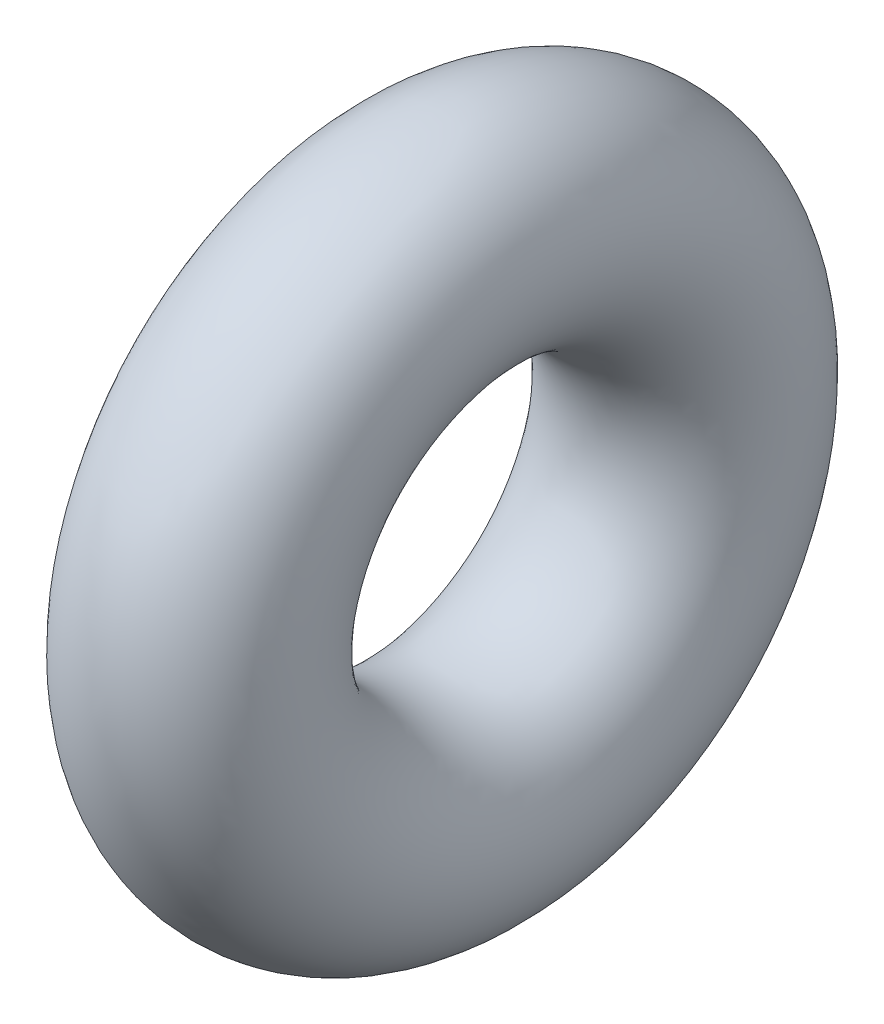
ISO-10303-21;
HEADER;
FILE_DESCRIPTION(('STEP AP214'),'2;1');
FILE_NAME('part.step','',(''),(''),'','','');
FILE_SCHEMA(('AUTOMOTIVE_DESIGN { 1 0 10303 214 1 1 1 1 }'));
ENDSEC;
DATA;
#1=APPLICATION_CONTEXT('core data for automotive mechanical design processes');
#2=APPLICATION_PROTOCOL_DEFINITION('international standard','automotive_design',2000,#1);
#3=PRODUCT_CONTEXT('',#1,'mechanical');
#4=PRODUCT('Part','Part','',(#3));
#5=PRODUCT_RELATED_PRODUCT_CATEGORY('part','',(#4));
#6=PRODUCT_DEFINITION_FORMATION('','',#4);
#7=PRODUCT_DEFINITION_CONTEXT('part definition',#1,'design');
#8=PRODUCT_DEFINITION('design','',#6,#7);
#9=PRODUCT_DEFINITION_SHAPE('','',#8);
#10=(LENGTH_UNIT() NAMED_UNIT(*) SI_UNIT(.MILLI.,.METRE.));
#11=(NAMED_UNIT(*) PLANE_ANGLE_UNIT() SI_UNIT($,.RADIAN.));
#12=(NAMED_UNIT(*) SI_UNIT($,.STERADIAN.) SOLID_ANGLE_UNIT());
#13=UNCERTAINTY_MEASURE_WITH_UNIT(LENGTH_MEASURE(1.E-05),#10,'distance_accuracy_value','');
#14=(GEOMETRIC_REPRESENTATION_CONTEXT(3) GLOBAL_UNCERTAINTY_ASSIGNED_CONTEXT((#13)) GLOBAL_UNIT_ASSIGNED_CONTEXT((#10,
#11,#12)) REPRESENTATION_CONTEXT('',''));
#15=CARTESIAN_POINT('',(0.,0.,0.));
#16=DIRECTION('',(0.,0.,1.));
#17=DIRECTION('',(1.,0.,0.));
#18=AXIS2_PLACEMENT_3D('',#15,#16,#17);
#19=CARTESIAN_POINT('',(2.6,0.,0.));
#20=DIRECTION('',(-1.,0.,0.));
#21=DIRECTION('',(0.,0.,1.));
#22=AXIS2_PLACEMENT_3D('',#19,#20,#21);
#23=TOROIDAL_SURFACE('',#22,1.35,0.599999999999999);
#24=CARTESIAN_POINT('',(2.6,0.,1.95));
#25=VERTEX_POINT('',#24);
#26=VERTEX_LOOP('',#25);
#27=FACE_BOUND('',#26,.T.);
#28=ADVANCED_FACE('F358',(#27),#23,.T.);
#29=CLOSED_SHELL('',(#28));
#30=MANIFOLD_SOLID_BREP('B2',#29);
#31=ADVANCED_BREP_SHAPE_REPRESENTATION('',(#18,#30),#14);
#32=SHAPE_DEFINITION_REPRESENTATION(#9,#31);
ENDSEC;
END-ISO-10303-21;
